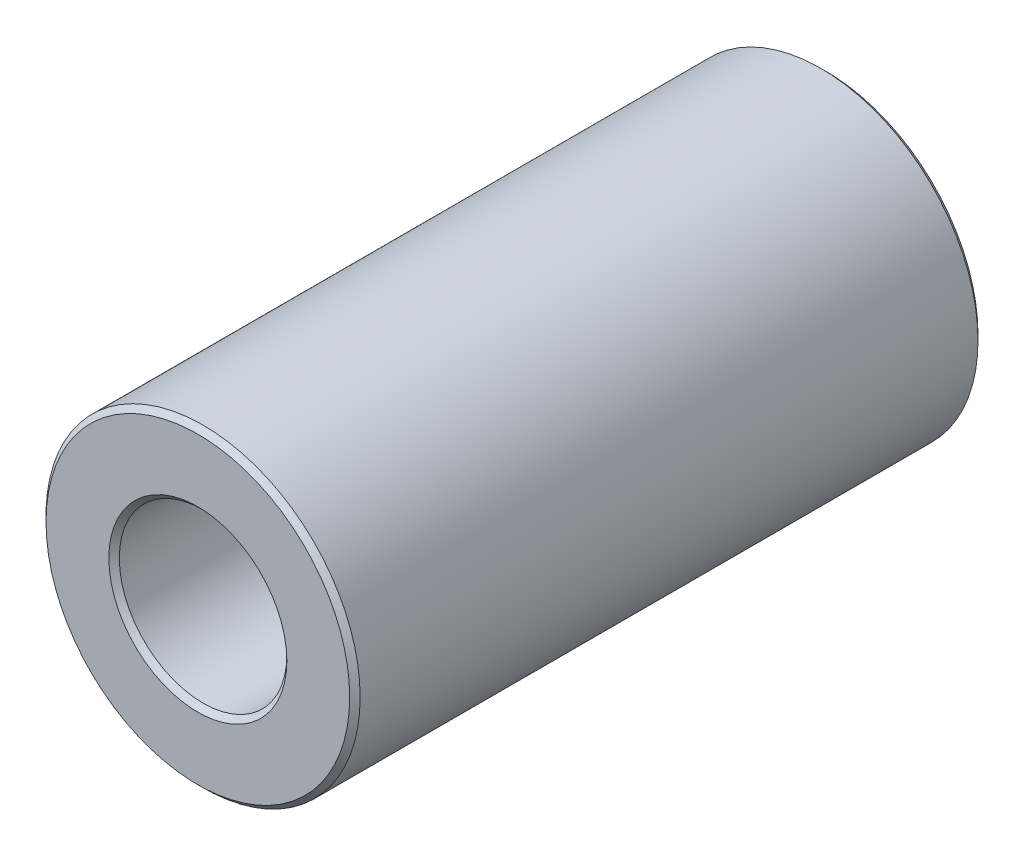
ISO-10303-21;
HEADER;
FILE_DESCRIPTION(('STEP AP214'),'2;1');
FILE_NAME('part.step','',(''),(''),'','','');
FILE_SCHEMA(('AUTOMOTIVE_DESIGN { 1 0 10303 214 1 1 1 1 }'));
ENDSEC;
DATA;
#1=APPLICATION_CONTEXT('core data for automotive mechanical design processes');
#2=APPLICATION_PROTOCOL_DEFINITION('international standard','automotive_design',2000,#1);
#3=PRODUCT_CONTEXT('',#1,'mechanical');
#4=PRODUCT('Part','Part','',(#3));
#5=PRODUCT_RELATED_PRODUCT_CATEGORY('part','',(#4));
#6=PRODUCT_DEFINITION_FORMATION('','',#4);
#7=PRODUCT_DEFINITION_CONTEXT('part definition',#1,'design');
#8=PRODUCT_DEFINITION('design','',#6,#7);
#9=PRODUCT_DEFINITION_SHAPE('','',#8);
#10=(LENGTH_UNIT() NAMED_UNIT(*) SI_UNIT(.MILLI.,.METRE.));
#11=(NAMED_UNIT(*) PLANE_ANGLE_UNIT() SI_UNIT($,.RADIAN.));
#12=(NAMED_UNIT(*) SI_UNIT($,.STERADIAN.) SOLID_ANGLE_UNIT());
#13=UNCERTAINTY_MEASURE_WITH_UNIT(LENGTH_MEASURE(1.E-05),#10,'distance_accuracy_value','');
#14=(GEOMETRIC_REPRESENTATION_CONTEXT(3) GLOBAL_UNCERTAINTY_ASSIGNED_CONTEXT((#13)) GLOBAL_UNIT_ASSIGNED_CONTEXT((#10,
#11,#12)) REPRESENTATION_CONTEXT('',''));
#15=CARTESIAN_POINT('',(0.,0.,0.));
#16=DIRECTION('',(0.,0.,1.));
#17=DIRECTION('',(1.,0.,0.));
#18=AXIS2_PLACEMENT_3D('',#15,#16,#17);
#19=CARTESIAN_POINT('',(0.,0.,6.));
#20=DIRECTION('',(0.,0.,1.));
#21=DIRECTION('',(1.,0.,0.));
#22=AXIS2_PLACEMENT_3D('',#19,#20,#21);
#23=PLANE('',#22);
#24=CARTESIAN_POINT('',(0.,0.,6.));
#25=DIRECTION('',(0.,0.,1.));
#26=DIRECTION('',(1.,0.,0.));
#27=AXIS2_PLACEMENT_3D('',#24,#25,#26);
#28=CIRCLE('',#27,1.7);
#29=CARTESIAN_POINT('',(1.7,0.,6.));
#30=VERTEX_POINT('',#29);
#31=EDGE_CURVE('E10',#30,#30,#28,.F.);
#32=ORIENTED_EDGE('',*,*,#31,.T.);
#33=EDGE_LOOP('',(#32));
#34=FACE_BOUND('',#33,.T.);
#35=CARTESIAN_POINT('',(0.,0.,6.));
#36=DIRECTION('',(0.,0.,1.));
#37=DIRECTION('',(1.,0.,0.));
#38=AXIS2_PLACEMENT_3D('',#35,#36,#37);
#39=CIRCLE('',#38,2.9);
#40=CARTESIAN_POINT('',(2.9,0.,6.));
#41=VERTEX_POINT('',#40);
#42=EDGE_CURVE('E45',#41,#41,#39,.T.);
#43=ORIENTED_EDGE('',*,*,#42,.T.);
#44=EDGE_LOOP('',(#43));
#45=FACE_BOUND('',#44,.T.);
#46=ADVANCED_FACE('F37',(#34,#45),#23,.T.);
#47=CARTESIAN_POINT('',(0.,0.,-6.));
#48=DIRECTION('',(0.,0.,1.));
#49=DIRECTION('',(1.,0.,0.));
#50=AXIS2_PLACEMENT_3D('',#47,#48,#49);
#51=PLANE('',#50);
#52=CARTESIAN_POINT('',(0.,0.,-6.));
#53=DIRECTION('',(0.,0.,1.));
#54=DIRECTION('',(1.,0.,0.));
#55=AXIS2_PLACEMENT_3D('',#52,#53,#54);
#56=CIRCLE('',#55,2.90000000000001);
#57=CARTESIAN_POINT('',(2.90000000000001,0.,-6.));
#58=VERTEX_POINT('',#57);
#59=EDGE_CURVE('E63',#58,#58,#56,.F.);
#60=ORIENTED_EDGE('',*,*,#59,.T.);
#61=EDGE_LOOP('',(#60));
#62=FACE_BOUND('',#61,.T.);
#63=CARTESIAN_POINT('',(0.,0.,-6.));
#64=DIRECTION('',(0.,0.,1.));
#65=DIRECTION('',(1.,0.,0.));
#66=AXIS2_PLACEMENT_3D('',#63,#64,#65);
#67=CIRCLE('',#66,1.7);
#68=CARTESIAN_POINT('',(1.7,0.,-6.));
#69=VERTEX_POINT('',#68);
#70=EDGE_CURVE('E67',#69,#69,#67,.T.);
#71=ORIENTED_EDGE('',*,*,#70,.T.);
#72=EDGE_LOOP('',(#71));
#73=FACE_BOUND('',#72,.T.);
#74=ADVANCED_FACE('F89',(#62,#73),#51,.F.);
#75=CARTESIAN_POINT('',(0.,0.,6.));
#76=DIRECTION('',(0.,0.,-1.));
#77=DIRECTION('',(-1.,0.,0.));
#78=AXIS2_PLACEMENT_3D('',#75,#76,#77);
#79=CYLINDRICAL_SURFACE('',#78,3.);
#80=CARTESIAN_POINT('',(0.,0.,-5.90000000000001));
#81=DIRECTION('',(0.,0.,1.));
#82=DIRECTION('',(1.,0.,0.));
#83=AXIS2_PLACEMENT_3D('',#80,#81,#82);
#84=CIRCLE('',#83,3.);
#85=CARTESIAN_POINT('',(3.,0.,-5.90000000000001));
#86=VERTEX_POINT('',#85);
#87=EDGE_CURVE('E70',#86,#86,#84,.T.);
#88=ORIENTED_EDGE('',*,*,#87,.T.);
#89=EDGE_LOOP('',(#88));
#90=FACE_BOUND('',#89,.T.);
#91=CARTESIAN_POINT('',(0.,0.,5.9));
#92=DIRECTION('',(0.,0.,1.));
#93=DIRECTION('',(1.,0.,0.));
#94=AXIS2_PLACEMENT_3D('',#91,#92,#93);
#95=CIRCLE('',#94,3.);
#96=CARTESIAN_POINT('',(3.,0.,5.9));
#97=VERTEX_POINT('',#96);
#98=EDGE_CURVE('E74',#97,#97,#95,.F.);
#99=ORIENTED_EDGE('',*,*,#98,.T.);
#100=EDGE_LOOP('',(#99));
#101=FACE_BOUND('',#100,.T.);
#102=ADVANCED_FACE('F78',(#90,#101),#79,.T.);
#103=CARTESIAN_POINT('',(0.,0.,6.));
#104=DIRECTION('',(0.,0.,-1.));
#105=DIRECTION('',(-1.,0.,0.));
#106=AXIS2_PLACEMENT_3D('',#103,#104,#105);
#107=CYLINDRICAL_SURFACE('',#106,1.6);
#108=CARTESIAN_POINT('',(0.,0.,-5.9));
#109=DIRECTION('',(0.,0.,1.));
#110=DIRECTION('',(1.,0.,0.));
#111=AXIS2_PLACEMENT_3D('',#108,#109,#110);
#112=CIRCLE('',#111,1.6);
#113=CARTESIAN_POINT('',(1.6,0.,-5.9));
#114=VERTEX_POINT('',#113);
#115=EDGE_CURVE('E52',#114,#114,#112,.F.);
#116=ORIENTED_EDGE('',*,*,#115,.T.);
#117=EDGE_LOOP('',(#116));
#118=FACE_BOUND('',#117,.T.);
#119=CARTESIAN_POINT('',(0.,0.,5.9));
#120=DIRECTION('',(0.,0.,1.));
#121=DIRECTION('',(1.,0.,0.));
#122=AXIS2_PLACEMENT_3D('',#119,#120,#121);
#123=CIRCLE('',#122,1.6);
#124=CARTESIAN_POINT('',(1.6,0.,5.9));
#125=VERTEX_POINT('',#124);
#126=EDGE_CURVE('E58',#125,#125,#123,.T.);
#127=ORIENTED_EDGE('',*,*,#126,.T.);
#128=EDGE_LOOP('',(#127));
#129=FACE_BOUND('',#128,.T.);
#130=ADVANCED_FACE('F97',(#118,#129),#107,.F.);
#131=CARTESIAN_POINT('',(0.,0.,-5.90000000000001));
#132=DIRECTION('',(0.,0.,1.));
#133=DIRECTION('',(1.,0.,0.));
#134=AXIS2_PLACEMENT_3D('',#131,#132,#133);
#135=CONICAL_SURFACE('',#134,3.,0.78539816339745);
#136=CARTESIAN_POINT('',(2.90000000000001,0.,-6.));
#137=CARTESIAN_POINT('',(2.90104166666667,0.,-5.99895833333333));
#138=CARTESIAN_POINT('',(2.90208333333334,0.,-5.99791666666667));
#139=CARTESIAN_POINT('',(2.90416666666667,0.,-5.99583333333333));
#140=CARTESIAN_POINT('',(2.90520833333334,0.,-5.99479166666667));
#141=CARTESIAN_POINT('',(2.90729166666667,0.,-5.99270833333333));
#142=CARTESIAN_POINT('',(2.90833333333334,0.,-5.99166666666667));
#143=CARTESIAN_POINT('',(2.91041666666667,0.,-5.98958333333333));
#144=CARTESIAN_POINT('',(2.91145833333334,0.,-5.98854166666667));
#145=CARTESIAN_POINT('',(2.91354166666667,0.,-5.98645833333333));
#146=CARTESIAN_POINT('',(2.91458333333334,0.,-5.98541666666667));
#147=CARTESIAN_POINT('',(2.91666666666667,0.,-5.98333333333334));
#148=CARTESIAN_POINT('',(2.91770833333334,0.,-5.98229166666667));
#149=CARTESIAN_POINT('',(2.91979166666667,0.,-5.98020833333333));
#150=CARTESIAN_POINT('',(2.92083333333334,0.,-5.97916666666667));
#151=CARTESIAN_POINT('',(2.92291666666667,0.,-5.97708333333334));
#152=CARTESIAN_POINT('',(2.92395833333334,0.,-5.97604166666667));
#153=CARTESIAN_POINT('',(2.92604166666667,0.,-5.97395833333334));
#154=CARTESIAN_POINT('',(2.92708333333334,0.,-5.97291666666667));
#155=CARTESIAN_POINT('',(2.92916666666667,0.,-5.97083333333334));
#156=CARTESIAN_POINT('',(2.93020833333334,0.,-5.96979166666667));
#157=CARTESIAN_POINT('',(2.93229166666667,0.,-5.96770833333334));
#158=CARTESIAN_POINT('',(2.93333333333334,0.,-5.96666666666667));
#159=CARTESIAN_POINT('',(2.93541666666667,0.,-5.96458333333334));
#160=CARTESIAN_POINT('',(2.93645833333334,0.,-5.96354166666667));
#161=CARTESIAN_POINT('',(2.93854166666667,0.,-5.96145833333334));
#162=CARTESIAN_POINT('',(2.93958333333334,0.,-5.96041666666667));
#163=CARTESIAN_POINT('',(2.94166666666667,0.,-5.95833333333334));
#164=CARTESIAN_POINT('',(2.94270833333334,0.,-5.95729166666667));
#165=CARTESIAN_POINT('',(2.94479166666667,0.,-5.95520833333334));
#166=CARTESIAN_POINT('',(2.94583333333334,0.,-5.95416666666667));
#167=CARTESIAN_POINT('',(2.94791666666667,0.,-5.95208333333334));
#168=CARTESIAN_POINT('',(2.94895833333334,0.,-5.95104166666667));
#169=CARTESIAN_POINT('',(2.95104166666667,0.,-5.94895833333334));
#170=CARTESIAN_POINT('',(2.95208333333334,0.,-5.94791666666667));
#171=CARTESIAN_POINT('',(2.95416666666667,0.,-5.94583333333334));
#172=CARTESIAN_POINT('',(2.95520833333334,0.,-5.94479166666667));
#173=CARTESIAN_POINT('',(2.95729166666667,0.,-5.94270833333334));
#174=CARTESIAN_POINT('',(2.95833333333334,0.,-5.94166666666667));
#175=CARTESIAN_POINT('',(2.96041666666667,0.,-5.93958333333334));
#176=CARTESIAN_POINT('',(2.96145833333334,0.,-5.93854166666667));
#177=CARTESIAN_POINT('',(2.96354166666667,0.,-5.93645833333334));
#178=CARTESIAN_POINT('',(2.96458333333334,0.,-5.93541666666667));
#179=CARTESIAN_POINT('',(2.96666666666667,0.,-5.93333333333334));
#180=CARTESIAN_POINT('',(2.96770833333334,0.,-5.93229166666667));
#181=CARTESIAN_POINT('',(2.96979166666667,0.,-5.93020833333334));
#182=CARTESIAN_POINT('',(2.97083333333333,0.,-5.92916666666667));
#183=CARTESIAN_POINT('',(2.97291666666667,0.,-5.92708333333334));
#184=CARTESIAN_POINT('',(2.97395833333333,0.,-5.92604166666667));
#185=CARTESIAN_POINT('',(2.97604166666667,0.,-5.92395833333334));
#186=CARTESIAN_POINT('',(2.97708333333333,0.,-5.92291666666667));
#187=CARTESIAN_POINT('',(2.97916666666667,0.,-5.92083333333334));
#188=CARTESIAN_POINT('',(2.98020833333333,0.,-5.91979166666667));
#189=CARTESIAN_POINT('',(2.98229166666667,0.,-5.91770833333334));
#190=CARTESIAN_POINT('',(2.98333333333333,0.,-5.91666666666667));
#191=CARTESIAN_POINT('',(2.98541666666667,0.,-5.91458333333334));
#192=CARTESIAN_POINT('',(2.98645833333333,0.,-5.91354166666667));
#193=CARTESIAN_POINT('',(2.98854166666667,0.,-5.91145833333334));
#194=CARTESIAN_POINT('',(2.98958333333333,0.,-5.91041666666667));
#195=CARTESIAN_POINT('',(2.99166666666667,0.,-5.90833333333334));
#196=CARTESIAN_POINT('',(2.99270833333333,0.,-5.90729166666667));
#197=CARTESIAN_POINT('',(2.99479166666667,0.,-5.90520833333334));
#198=CARTESIAN_POINT('',(2.99583333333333,0.,-5.90416666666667));
#199=CARTESIAN_POINT('',(2.99791666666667,0.,-5.90208333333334));
#200=CARTESIAN_POINT('',(2.99895833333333,0.,-5.90104166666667));
#201=CARTESIAN_POINT('',(3.,0.,-5.90000000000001));
#202=B_SPLINE_CURVE_WITH_KNOTS('',3,(#136,#137,#138,#139,#140,#141,#142,#143,#144,#145,#146,
#147,#148,#149,#150,#151,#152,#153,#154,#155,#156,#157,#158,#159,#160,#161,#162,#163,#164,#165,
#166,#167,#168,#169,#170,#171,#172,#173,#174,#175,#176,#177,#178,#179,#180,#181,#182,#183,#184,
#185,#186,#187,#188,#189,#190,#191,#192,#193,#194,#195,#196,#197,#198,#199,#200,#201),
.UNSPECIFIED.,.F.,.F.,(4,2,2,2,2,2,2,2,2,2,2,2,2,2,2,2,2,2,2,2,2,2,2,2,2,2,2,2,2,2,2,2,4),(0.,
0.00441941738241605,0.00883883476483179,0.0132582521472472,0.017677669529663,0.0220970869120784,
0.0265165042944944,0.0309359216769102,0.0353553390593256,0.0397747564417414,0.0441941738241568,
0.0486135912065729,0.0530330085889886,0.057452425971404,0.0618718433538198,0.0662912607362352,
0.0707106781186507,0.075130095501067,0.0795495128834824,0.0839689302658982,0.0883883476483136,
0.0928077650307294,0.0972271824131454,0.101646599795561,0.106066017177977,0.110485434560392,
0.114904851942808,0.119324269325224,0.123743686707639,0.128163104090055,0.13258252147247,
0.137001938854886,0.141421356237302),.UNSPECIFIED.);
#203=EDGE_CURVE('BSEAM102',#58,#86,#202,.T.);
#204=ORIENTED_EDGE('',*,*,#59,.F.);
#205=ORIENTED_EDGE('',*,*,#87,.F.);
#206=ORIENTED_EDGE('',*,*,#203,.T.);
#207=ORIENTED_EDGE('',*,*,#203,.F.);
#208=EDGE_LOOP('',(#204,#206,#205,#207));
#209=FACE_BOUND('',#208,.T.);
#210=ADVANCED_FACE('F102',(#209),#135,.T.);
#211=CARTESIAN_POINT('',(0.,0.,-6.));
#212=DIRECTION('',(0.,0.,-1.));
#213=DIRECTION('',(-1.,0.,0.));
#214=AXIS2_PLACEMENT_3D('',#211,#212,#213);
#215=CONICAL_SURFACE('',#214,1.7,0.785398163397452);
#216=ORIENTED_EDGE('',*,*,#115,.F.);
#217=EDGE_LOOP('',(#216));
#218=FACE_BOUND('',#217,.T.);
#219=ORIENTED_EDGE('',*,*,#70,.F.);
#220=EDGE_LOOP('',(#219));
#221=FACE_BOUND('',#220,.T.);
#222=ADVANCED_FACE('F86',(#218,#221),#215,.F.);
#223=CARTESIAN_POINT('',(0.,0.,5.9));
#224=DIRECTION('',(0.,0.,1.));
#225=DIRECTION('',(1.,0.,0.));
#226=AXIS2_PLACEMENT_3D('',#223,#224,#225);
#227=CONICAL_SURFACE('',#226,1.6,0.785398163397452);
#228=ORIENTED_EDGE('',*,*,#31,.F.);
#229=EDGE_LOOP('',(#228));
#230=FACE_BOUND('',#229,.T.);
#231=ORIENTED_EDGE('',*,*,#126,.F.);
#232=EDGE_LOOP('',(#231));
#233=FACE_BOUND('',#232,.T.);
#234=ADVANCED_FACE('F82',(#230,#233),#227,.F.);
#235=CARTESIAN_POINT('',(0.,0.,6.));
#236=DIRECTION('',(0.,0.,-1.));
#237=DIRECTION('',(-1.,0.,0.));
#238=AXIS2_PLACEMENT_3D('',#235,#236,#237);
#239=CONICAL_SURFACE('',#238,2.9,0.78539816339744);
#240=ORIENTED_EDGE('',*,*,#98,.F.);
#241=EDGE_LOOP('',(#240));
#242=FACE_BOUND('',#241,.T.);
#243=ORIENTED_EDGE('',*,*,#42,.F.);
#244=EDGE_LOOP('',(#243));
#245=FACE_BOUND('',#244,.T.);
#246=ADVANCED_FACE('F39',(#242,#245),#239,.T.);
#247=CLOSED_SHELL('',(#46,#74,#102,#130,#210,#222,#234,#246));
#248=MANIFOLD_SOLID_BREP('B2',#247);
#249=ADVANCED_BREP_SHAPE_REPRESENTATION('',(#18,#248),#14);
#250=SHAPE_DEFINITION_REPRESENTATION(#9,#249);
ENDSEC;
END-ISO-10303-21;
